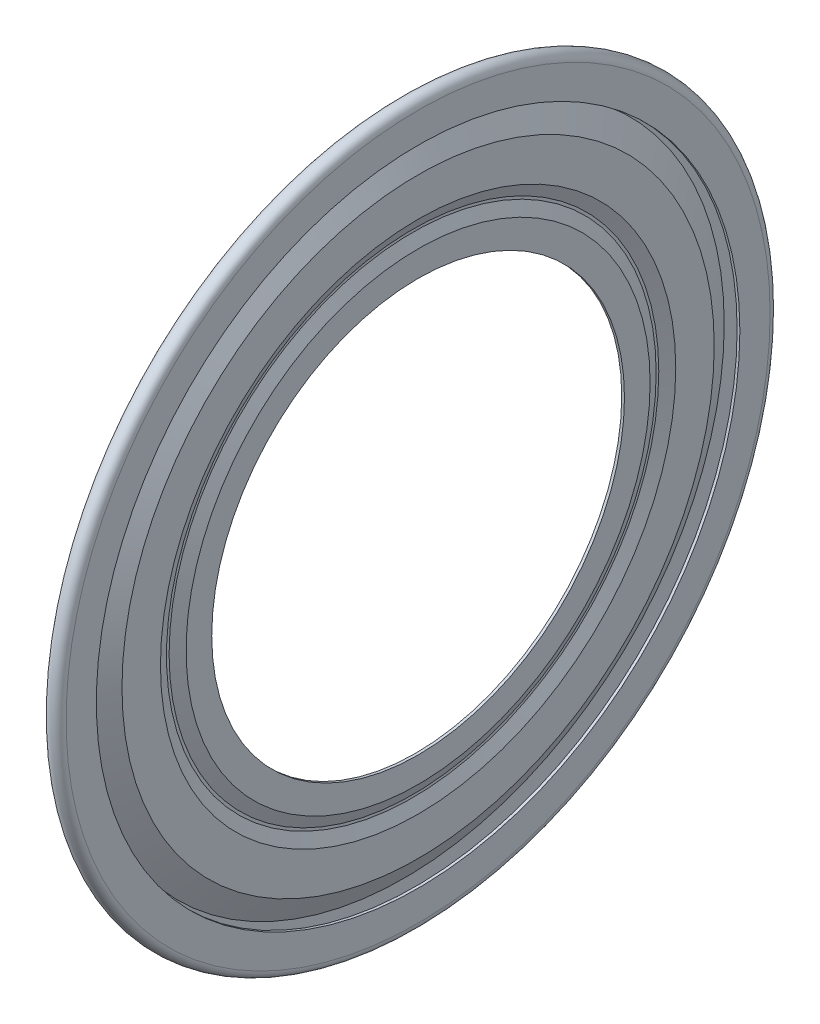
ISO-10303-21;
HEADER;
FILE_DESCRIPTION(('STEP AP214'),'2;1');
FILE_NAME('part.step','',(''),(''),'','','');
FILE_SCHEMA(('AUTOMOTIVE_DESIGN { 1 0 10303 214 1 1 1 1 }'));
ENDSEC;
DATA;
#1=APPLICATION_CONTEXT('core data for automotive mechanical design processes');
#2=APPLICATION_PROTOCOL_DEFINITION('international standard','automotive_design',2000,#1);
#3=PRODUCT_CONTEXT('',#1,'mechanical');
#4=PRODUCT('Part','Part','',(#3));
#5=PRODUCT_RELATED_PRODUCT_CATEGORY('part','',(#4));
#6=PRODUCT_DEFINITION_FORMATION('','',#4);
#7=PRODUCT_DEFINITION_CONTEXT('part definition',#1,'design');
#8=PRODUCT_DEFINITION('design','',#6,#7);
#9=PRODUCT_DEFINITION_SHAPE('','',#8);
#10=(LENGTH_UNIT() NAMED_UNIT(*) SI_UNIT(.MILLI.,.METRE.));
#11=(NAMED_UNIT(*) PLANE_ANGLE_UNIT() SI_UNIT($,.RADIAN.));
#12=(NAMED_UNIT(*) SI_UNIT($,.STERADIAN.) SOLID_ANGLE_UNIT());
#13=UNCERTAINTY_MEASURE_WITH_UNIT(LENGTH_MEASURE(1.E-05),#10,'distance_accuracy_value','');
#14=(GEOMETRIC_REPRESENTATION_CONTEXT(3) GLOBAL_UNCERTAINTY_ASSIGNED_CONTEXT((#13)) GLOBAL_UNIT_ASSIGNED_CONTEXT((#10,
#11,#12)) REPRESENTATION_CONTEXT('',''));
#15=CARTESIAN_POINT('',(0.,0.,0.));
#16=DIRECTION('',(0.,0.,1.));
#17=DIRECTION('',(1.,0.,0.));
#18=AXIS2_PLACEMENT_3D('',#15,#16,#17);
#19=CARTESIAN_POINT('',(8.85,0.,0.));
#20=DIRECTION('',(-1.,0.,0.));
#21=DIRECTION('',(0.,0.,1.));
#22=AXIS2_PLACEMENT_3D('',#19,#20,#21);
#23=CONICAL_SURFACE('',#22,10.8208184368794,1.0471975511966);
#24=CARTESIAN_POINT('',(8.35,0.,0.));
#25=DIRECTION('',(1.,0.,0.));
#26=DIRECTION('',(0.,0.,-1.));
#27=AXIS2_PLACEMENT_3D('',#24,#25,#26);
#28=CIRCLE('',#27,11.6868438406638);
#29=CARTESIAN_POINT('',(8.35,0.,-11.6868438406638));
#30=VERTEX_POINT('',#29);
#31=EDGE_CURVE('E103',#30,#30,#28,.T.);
#32=ORIENTED_EDGE('',*,*,#31,.T.);
#33=EDGE_LOOP('',(#32));
#34=FACE_BOUND('',#33,.T.);
#35=CARTESIAN_POINT('',(8.85,0.,0.));
#36=DIRECTION('',(1.,0.,0.));
#37=DIRECTION('',(0.,0.,-1.));
#38=AXIS2_PLACEMENT_3D('',#35,#36,#37);
#39=CIRCLE('',#38,10.8208184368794);
#40=CARTESIAN_POINT('',(8.85,0.,-10.8208184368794));
#41=VERTEX_POINT('',#40);
#42=EDGE_CURVE('E10',#41,#41,#39,.T.);
#43=ORIENTED_EDGE('',*,*,#42,.F.);
#44=EDGE_LOOP('',(#43));
#45=FACE_BOUND('',#44,.T.);
#46=ADVANCED_FACE('F14',(#34,#45),#23,.T.);
#47=CARTESIAN_POINT('',(8.85,9.41527102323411,0.));
#48=DIRECTION('',(1.,0.,0.));
#49=DIRECTION('',(0.,0.,-1.));
#50=AXIS2_PLACEMENT_3D('',#47,#48,#49);
#51=PLANE('',#50);
#52=ORIENTED_EDGE('',*,*,#42,.T.);
#53=EDGE_LOOP('',(#52));
#54=FACE_BOUND('',#53,.T.);
#55=CARTESIAN_POINT('',(8.85,0.,0.));
#56=DIRECTION('',(1.,0.,0.));
#57=DIRECTION('',(0.,0.,-1.));
#58=AXIS2_PLACEMENT_3D('',#55,#56,#57);
#59=CIRCLE('',#58,9.41527102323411);
#60=CARTESIAN_POINT('',(8.85,0.,-9.41527102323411));
#61=VERTEX_POINT('',#60);
#62=EDGE_CURVE('E21',#61,#61,#59,.T.);
#63=ORIENTED_EDGE('',*,*,#62,.F.);
#64=EDGE_LOOP('',(#63));
#65=FACE_BOUND('',#64,.T.);
#66=ADVANCED_FACE('F124',(#54,#65),#51,.T.);
#67=CARTESIAN_POINT('',(8.65,0.,0.));
#68=DIRECTION('',(1.,0.,0.));
#69=DIRECTION('',(0.,0.,-1.));
#70=AXIS2_PLACEMENT_3D('',#67,#68,#69);
#71=CONICAL_SURFACE('',#70,8.99460893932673,1.12698823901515);
#72=ORIENTED_EDGE('',*,*,#62,.T.);
#73=EDGE_LOOP('',(#72));
#74=FACE_BOUND('',#73,.T.);
#75=CARTESIAN_POINT('',(8.65,0.,0.));
#76=DIRECTION('',(1.,0.,0.));
#77=DIRECTION('',(0.,0.,-1.));
#78=AXIS2_PLACEMENT_3D('',#75,#76,#77);
#79=CIRCLE('',#78,8.99460893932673);
#80=CARTESIAN_POINT('',(8.65,0.,-8.99460893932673));
#81=VERTEX_POINT('',#80);
#82=EDGE_CURVE('E30',#81,#81,#79,.T.);
#83=ORIENTED_EDGE('',*,*,#82,.F.);
#84=EDGE_LOOP('',(#83));
#85=FACE_BOUND('',#84,.T.);
#86=ADVANCED_FACE('F128',(#74,#85),#71,.F.);
#87=CARTESIAN_POINT('',(8.65,8.89890149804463,0.));
#88=DIRECTION('',(1.,0.,0.));
#89=DIRECTION('',(0.,0.,-1.));
#90=AXIS2_PLACEMENT_3D('',#87,#88,#89);
#91=PLANE('',#90);
#92=ORIENTED_EDGE('',*,*,#82,.T.);
#93=EDGE_LOOP('',(#92));
#94=FACE_BOUND('',#93,.T.);
#95=CARTESIAN_POINT('',(8.65,0.,0.));
#96=DIRECTION('',(1.,0.,0.));
#97=DIRECTION('',(0.,0.,-1.));
#98=AXIS2_PLACEMENT_3D('',#95,#96,#97);
#99=CIRCLE('',#98,8.89890149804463);
#100=CARTESIAN_POINT('',(8.65,0.,-8.89890149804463));
#101=VERTEX_POINT('',#100);
#102=EDGE_CURVE('E37',#101,#101,#99,.T.);
#103=ORIENTED_EDGE('',*,*,#102,.F.);
#104=EDGE_LOOP('',(#103));
#105=FACE_BOUND('',#104,.T.);
#106=ADVANCED_FACE('F132',(#94,#105),#91,.T.);
#107=CARTESIAN_POINT('',(8.85,0.,0.));
#108=DIRECTION('',(-1.,0.,0.));
#109=DIRECTION('',(0.,0.,1.));
#110=AXIS2_PLACEMENT_3D('',#107,#108,#109);
#111=CONICAL_SURFACE('',#110,8.47823941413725,1.12698823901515);
#112=ORIENTED_EDGE('',*,*,#102,.T.);
#113=EDGE_LOOP('',(#112));
#114=FACE_BOUND('',#113,.T.);
#115=CARTESIAN_POINT('',(8.85,0.,0.));
#116=DIRECTION('',(1.,0.,0.));
#117=DIRECTION('',(0.,0.,-1.));
#118=AXIS2_PLACEMENT_3D('',#115,#116,#117);
#119=CIRCLE('',#118,8.47823941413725);
#120=CARTESIAN_POINT('',(8.85,0.,-8.47823941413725));
#121=VERTEX_POINT('',#120);
#122=EDGE_CURVE('E43',#121,#121,#119,.T.);
#123=ORIENTED_EDGE('',*,*,#122,.F.);
#124=EDGE_LOOP('',(#123));
#125=FACE_BOUND('',#124,.T.);
#126=ADVANCED_FACE('F138',(#114,#125),#111,.T.);
#127=CARTESIAN_POINT('',(8.85,7.54120780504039,0.));
#128=DIRECTION('',(1.,0.,0.));
#129=DIRECTION('',(0.,0.,-1.));
#130=AXIS2_PLACEMENT_3D('',#127,#128,#129);
#131=PLANE('',#130);
#132=ORIENTED_EDGE('',*,*,#122,.T.);
#133=EDGE_LOOP('',(#132));
#134=FACE_BOUND('',#133,.T.);
#135=CARTESIAN_POINT('',(8.85,0.,0.));
#136=DIRECTION('',(1.,0.,0.));
#137=DIRECTION('',(0.,0.,-1.));
#138=AXIS2_PLACEMENT_3D('',#135,#136,#137);
#139=CIRCLE('',#138,7.54120780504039);
#140=CARTESIAN_POINT('',(8.85,0.,-7.54120780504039));
#141=VERTEX_POINT('',#140);
#142=EDGE_CURVE('E47',#141,#141,#139,.T.);
#143=ORIENTED_EDGE('',*,*,#142,.F.);
#144=EDGE_LOOP('',(#143));
#145=FACE_BOUND('',#144,.T.);
#146=ADVANCED_FACE('F142',(#134,#145),#131,.T.);
#147=CARTESIAN_POINT('',(9.,0.,0.));
#148=DIRECTION('',(1.,0.,0.));
#149=DIRECTION('',(0.,0.,-1.));
#150=AXIS2_PLACEMENT_3D('',#147,#148,#149);
#151=CYLINDRICAL_SURFACE('',#150,7.54120780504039);
#152=ORIENTED_EDGE('',*,*,#142,.T.);
#153=EDGE_LOOP('',(#152));
#154=FACE_BOUND('',#153,.T.);
#155=CARTESIAN_POINT('',(8.75,0.,0.));
#156=DIRECTION('',(1.,0.,0.));
#157=DIRECTION('',(0.,0.,-1.));
#158=AXIS2_PLACEMENT_3D('',#155,#156,#157);
#159=CIRCLE('',#158,7.54120780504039);
#160=CARTESIAN_POINT('',(8.75,0.,-7.54120780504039));
#161=VERTEX_POINT('',#160);
#162=EDGE_CURVE('E51',#161,#161,#159,.T.);
#163=ORIENTED_EDGE('',*,*,#162,.F.);
#164=EDGE_LOOP('',(#163));
#165=FACE_BOUND('',#164,.T.);
#166=ADVANCED_FACE('F146',(#154,#165),#151,.F.);
#167=CARTESIAN_POINT('',(8.75,8.45567746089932,0.));
#168=DIRECTION('',(-1.,0.,0.));
#169=DIRECTION('',(0.,0.,1.));
#170=AXIS2_PLACEMENT_3D('',#167,#168,#169);
#171=PLANE('',#170);
#172=ORIENTED_EDGE('',*,*,#162,.T.);
#173=EDGE_LOOP('',(#172));
#174=FACE_BOUND('',#173,.T.);
#175=CARTESIAN_POINT('',(8.75,0.,0.));
#176=DIRECTION('',(1.,0.,0.));
#177=DIRECTION('',(0.,0.,-1.));
#178=AXIS2_PLACEMENT_3D('',#175,#176,#177);
#179=CIRCLE('',#178,8.45567746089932);
#180=CARTESIAN_POINT('',(8.75,0.,-8.45567746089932));
#181=VERTEX_POINT('',#180);
#182=EDGE_CURVE('E55',#181,#181,#179,.T.);
#183=ORIENTED_EDGE('',*,*,#182,.F.);
#184=EDGE_LOOP('',(#183));
#185=FACE_BOUND('',#184,.T.);
#186=ADVANCED_FACE('F150',(#174,#185),#171,.T.);
#187=CARTESIAN_POINT('',(8.55,0.,0.));
#188=DIRECTION('',(-1.,0.,0.));
#189=DIRECTION('',(0.,0.,1.));
#190=AXIS2_PLACEMENT_3D('',#187,#188,#189);
#191=CONICAL_SURFACE('',#190,8.8763395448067,1.12698823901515);
#192=ORIENTED_EDGE('',*,*,#182,.T.);
#193=EDGE_LOOP('',(#192));
#194=FACE_BOUND('',#193,.T.);
#195=CARTESIAN_POINT('',(8.55,0.,0.));
#196=DIRECTION('',(1.,0.,0.));
#197=DIRECTION('',(0.,0.,-1.));
#198=AXIS2_PLACEMENT_3D('',#195,#196,#197);
#199=CIRCLE('',#198,8.8763395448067);
#200=CARTESIAN_POINT('',(8.55,0.,-8.8763395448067));
#201=VERTEX_POINT('',#200);
#202=EDGE_CURVE('E59',#201,#201,#199,.T.);
#203=ORIENTED_EDGE('',*,*,#202,.F.);
#204=EDGE_LOOP('',(#203));
#205=FACE_BOUND('',#204,.T.);
#206=ADVANCED_FACE('F154',(#194,#205),#191,.F.);
#207=CARTESIAN_POINT('',(8.55,9.01717089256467,0.));
#208=DIRECTION('',(-1.,0.,0.));
#209=DIRECTION('',(0.,0.,1.));
#210=AXIS2_PLACEMENT_3D('',#207,#208,#209);
#211=PLANE('',#210);
#212=ORIENTED_EDGE('',*,*,#202,.T.);
#213=EDGE_LOOP('',(#212));
#214=FACE_BOUND('',#213,.T.);
#215=CARTESIAN_POINT('',(8.55,0.,0.));
#216=DIRECTION('',(1.,0.,0.));
#217=DIRECTION('',(0.,0.,-1.));
#218=AXIS2_PLACEMENT_3D('',#215,#216,#217);
#219=CIRCLE('',#218,9.01717089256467);
#220=CARTESIAN_POINT('',(8.55,0.,-9.01717089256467));
#221=VERTEX_POINT('',#220);
#222=EDGE_CURVE('E63',#221,#221,#219,.T.);
#223=ORIENTED_EDGE('',*,*,#222,.F.);
#224=EDGE_LOOP('',(#223));
#225=FACE_BOUND('',#224,.T.);
#226=ADVANCED_FACE('F158',(#214,#225),#211,.T.);
#227=CARTESIAN_POINT('',(8.75,0.,0.));
#228=DIRECTION('',(1.,0.,0.));
#229=DIRECTION('',(0.,0.,-1.));
#230=AXIS2_PLACEMENT_3D('',#227,#228,#229);
#231=CONICAL_SURFACE('',#230,9.43783297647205,1.12698823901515);
#232=ORIENTED_EDGE('',*,*,#222,.T.);
#233=EDGE_LOOP('',(#232));
#234=FACE_BOUND('',#233,.T.);
#235=CARTESIAN_POINT('',(8.75,0.,0.));
#236=DIRECTION('',(1.,0.,0.));
#237=DIRECTION('',(0.,0.,-1.));
#238=AXIS2_PLACEMENT_3D('',#235,#236,#237);
#239=CIRCLE('',#238,9.43783297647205);
#240=CARTESIAN_POINT('',(8.75,0.,-9.43783297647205));
#241=VERTEX_POINT('',#240);
#242=EDGE_CURVE('E67',#241,#241,#239,.T.);
#243=ORIENTED_EDGE('',*,*,#242,.F.);
#244=EDGE_LOOP('',(#243));
#245=FACE_BOUND('',#244,.T.);
#246=ADVANCED_FACE('F162',(#234,#245),#231,.T.);
#247=CARTESIAN_POINT('',(8.75,10.7940235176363,0.));
#248=DIRECTION('',(-1.,0.,0.));
#249=DIRECTION('',(0.,0.,1.));
#250=AXIS2_PLACEMENT_3D('',#247,#248,#249);
#251=PLANE('',#250);
#252=ORIENTED_EDGE('',*,*,#242,.T.);
#253=EDGE_LOOP('',(#252));
#254=FACE_BOUND('',#253,.T.);
#255=CARTESIAN_POINT('',(8.75,0.,0.));
#256=DIRECTION('',(1.,0.,0.));
#257=DIRECTION('',(0.,0.,-1.));
#258=AXIS2_PLACEMENT_3D('',#255,#256,#257);
#259=CIRCLE('',#258,10.7940235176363);
#260=CARTESIAN_POINT('',(8.75,0.,-10.7940235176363));
#261=VERTEX_POINT('',#260);
#262=EDGE_CURVE('E71',#261,#261,#259,.T.);
#263=ORIENTED_EDGE('',*,*,#262,.F.);
#264=EDGE_LOOP('',(#263));
#265=FACE_BOUND('',#264,.T.);
#266=ADVANCED_FACE('F166',(#254,#265),#251,.T.);
#267=CARTESIAN_POINT('',(8.25,0.,0.));
#268=DIRECTION('',(-1.,0.,0.));
#269=DIRECTION('',(0.,0.,1.));
#270=AXIS2_PLACEMENT_3D('',#267,#268,#269);
#271=CONICAL_SURFACE('',#270,11.6600489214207,1.0471975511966);
#272=ORIENTED_EDGE('',*,*,#262,.T.);
#273=EDGE_LOOP('',(#272));
#274=FACE_BOUND('',#273,.T.);
#275=CARTESIAN_POINT('',(8.25,0.,0.));
#276=DIRECTION('',(1.,0.,0.));
#277=DIRECTION('',(0.,0.,-1.));
#278=AXIS2_PLACEMENT_3D('',#275,#276,#277);
#279=CIRCLE('',#278,11.6600489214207);
#280=CARTESIAN_POINT('',(8.25,0.,-11.6600489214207));
#281=VERTEX_POINT('',#280);
#282=EDGE_CURVE('E75',#281,#281,#279,.T.);
#283=ORIENTED_EDGE('',*,*,#282,.F.);
#284=EDGE_LOOP('',(#283));
#285=FACE_BOUND('',#284,.T.);
#286=ADVANCED_FACE('F170',(#274,#285),#271,.F.);
#287=CARTESIAN_POINT('',(8.25,12.8633974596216,0.));
#288=DIRECTION('',(-1.,0.,0.));
#289=DIRECTION('',(0.,0.,1.));
#290=AXIS2_PLACEMENT_3D('',#287,#288,#289);
#291=PLANE('',#290);
#292=ORIENTED_EDGE('',*,*,#282,.T.);
#293=EDGE_LOOP('',(#292));
#294=FACE_BOUND('',#293,.T.);
#295=CARTESIAN_POINT('',(8.25,0.,0.));
#296=DIRECTION('',(1.,0.,0.));
#297=DIRECTION('',(0.,0.,-1.));
#298=AXIS2_PLACEMENT_3D('',#295,#296,#297);
#299=CIRCLE('',#298,12.8633974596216);
#300=CARTESIAN_POINT('',(8.25,0.,-12.8633974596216));
#301=VERTEX_POINT('',#300);
#302=EDGE_CURVE('E79',#301,#301,#299,.T.);
#303=ORIENTED_EDGE('',*,*,#302,.F.);
#304=EDGE_LOOP('',(#303));
#305=FACE_BOUND('',#304,.T.);
#306=ADVANCED_FACE('F174',(#294,#305),#291,.T.);
#307=CARTESIAN_POINT('',(8.55,0.,0.));
#308=DIRECTION('',(1.,0.,0.));
#309=DIRECTION('',(0.,0.,-1.));
#310=AXIS2_PLACEMENT_3D('',#307,#308,#309);
#311=TOROIDAL_SURFACE('',#310,12.8633974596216,0.3);
#312=CARTESIAN_POINT('',(8.85,0.,0.));
#313=DIRECTION('',(1.,0.,0.));
#314=DIRECTION('',(0.,0.,-1.));
#315=AXIS2_PLACEMENT_3D('',#312,#313,#314);
#316=CIRCLE('',#315,12.8633974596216);
#317=CARTESIAN_POINT('',(8.85,0.,-12.8633974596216));
#318=VERTEX_POINT('',#317);
#319=EDGE_CURVE('E83',#318,#318,#316,.T.);
#320=ORIENTED_EDGE('',*,*,#319,.F.);
#321=EDGE_LOOP('',(#320));
#322=FACE_BOUND('',#321,.T.);
#323=ORIENTED_EDGE('',*,*,#302,.T.);
#324=EDGE_LOOP('',(#323));
#325=FACE_BOUND('',#324,.T.);
#326=ADVANCED_FACE('F178',(#322,#325),#311,.T.);
#327=CARTESIAN_POINT('',(8.85,12.8633974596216,0.));
#328=DIRECTION('',(-1.,0.,0.));
#329=DIRECTION('',(0.,0.,1.));
#330=AXIS2_PLACEMENT_3D('',#327,#328,#329);
#331=PLANE('',#330);
#332=CARTESIAN_POINT('',(8.85,0.,0.));
#333=DIRECTION('',(1.,0.,0.));
#334=DIRECTION('',(0.,0.,-1.));
#335=AXIS2_PLACEMENT_3D('',#332,#333,#334);
#336=CIRCLE('',#335,11.7578500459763);
#337=CARTESIAN_POINT('',(8.85,0.,-11.7578500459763));
#338=VERTEX_POINT('',#337);
#339=EDGE_CURVE('E87',#338,#338,#336,.T.);
#340=ORIENTED_EDGE('',*,*,#339,.F.);
#341=EDGE_LOOP('',(#340));
#342=FACE_BOUND('',#341,.T.);
#343=ORIENTED_EDGE('',*,*,#319,.T.);
#344=EDGE_LOOP('',(#343));
#345=FACE_BOUND('',#344,.T.);
#346=ADVANCED_FACE('F182',(#342,#345),#331,.F.);
#347=CARTESIAN_POINT('',(9.,0.,0.));
#348=DIRECTION('',(1.,0.,0.));
#349=DIRECTION('',(0.,0.,-1.));
#350=AXIS2_PLACEMENT_3D('',#347,#348,#349);
#351=CYLINDRICAL_SURFACE('',#350,11.7578500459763);
#352=CARTESIAN_POINT('',(8.75,0.,0.));
#353=DIRECTION('',(1.,0.,0.));
#354=DIRECTION('',(0.,0.,-1.));
#355=AXIS2_PLACEMENT_3D('',#352,#353,#354);
#356=CIRCLE('',#355,11.7578500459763);
#357=CARTESIAN_POINT('',(8.75,0.,-11.7578500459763));
#358=VERTEX_POINT('',#357);
#359=EDGE_CURVE('E91',#358,#358,#356,.T.);
#360=ORIENTED_EDGE('',*,*,#359,.F.);
#361=EDGE_LOOP('',(#360));
#362=FACE_BOUND('',#361,.T.);
#363=ORIENTED_EDGE('',*,*,#339,.T.);
#364=EDGE_LOOP('',(#363));
#365=FACE_BOUND('',#364,.T.);
#366=ADVANCED_FACE('F186',(#362,#365),#351,.F.);
#367=CARTESIAN_POINT('',(8.75,12.8633974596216,0.));
#368=DIRECTION('',(-1.,0.,0.));
#369=DIRECTION('',(0.,0.,1.));
#370=AXIS2_PLACEMENT_3D('',#367,#368,#369);
#371=PLANE('',#370);
#372=ORIENTED_EDGE('',*,*,#359,.T.);
#373=EDGE_LOOP('',(#372));
#374=FACE_BOUND('',#373,.T.);
#375=CARTESIAN_POINT('',(8.75,0.,0.));
#376=DIRECTION('',(1.,0.,0.));
#377=DIRECTION('',(0.,0.,-1.));
#378=AXIS2_PLACEMENT_3D('',#375,#376,#377);
#379=CIRCLE('',#378,12.8633974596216);
#380=CARTESIAN_POINT('',(8.75,0.,-12.8633974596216));
#381=VERTEX_POINT('',#380);
#382=EDGE_CURVE('E95',#381,#381,#379,.T.);
#383=ORIENTED_EDGE('',*,*,#382,.F.);
#384=EDGE_LOOP('',(#383));
#385=FACE_BOUND('',#384,.T.);
#386=ADVANCED_FACE('F120',(#374,#385),#371,.T.);
#387=CARTESIAN_POINT('',(8.55,0.,0.));
#388=DIRECTION('',(1.,0.,0.));
#389=DIRECTION('',(0.,0.,-1.));
#390=AXIS2_PLACEMENT_3D('',#387,#388,#389);
#391=TOROIDAL_SURFACE('',#390,12.8633974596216,0.2);
#392=ORIENTED_EDGE('',*,*,#382,.T.);
#393=EDGE_LOOP('',(#392));
#394=FACE_BOUND('',#393,.T.);
#395=CARTESIAN_POINT('',(8.35,0.,0.));
#396=DIRECTION('',(1.,0.,0.));
#397=DIRECTION('',(0.,0.,-1.));
#398=AXIS2_PLACEMENT_3D('',#395,#396,#397);
#399=CIRCLE('',#398,12.8633974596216);
#400=CARTESIAN_POINT('',(8.35,0.,-12.8633974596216));
#401=VERTEX_POINT('',#400);
#402=EDGE_CURVE('E99',#401,#401,#399,.T.);
#403=ORIENTED_EDGE('',*,*,#402,.F.);
#404=EDGE_LOOP('',(#403));
#405=FACE_BOUND('',#404,.T.);
#406=ADVANCED_FACE('F113',(#394,#405),#391,.F.);
#407=CARTESIAN_POINT('',(8.35,11.6868438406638,0.));
#408=DIRECTION('',(1.,0.,0.));
#409=DIRECTION('',(0.,0.,-1.));
#410=AXIS2_PLACEMENT_3D('',#407,#408,#409);
#411=PLANE('',#410);
#412=ORIENTED_EDGE('',*,*,#402,.T.);
#413=EDGE_LOOP('',(#412));
#414=FACE_BOUND('',#413,.T.);
#415=ORIENTED_EDGE('',*,*,#31,.F.);
#416=EDGE_LOOP('',(#415));
#417=FACE_BOUND('',#416,.T.);
#418=ADVANCED_FACE('F111',(#414,#417),#411,.T.);
#419=CLOSED_SHELL('',(#46,#66,#86,#106,#126,#146,#166,#186,#206,#226,#246,#266,#286,#306,#326,
#346,#366,#386,#406,#418));
#420=MANIFOLD_SOLID_BREP('B1',#419);
#421=ADVANCED_BREP_SHAPE_REPRESENTATION('',(#18,#420),#14);
#422=SHAPE_DEFINITION_REPRESENTATION(#9,#421);
ENDSEC;
END-ISO-10303-21;
